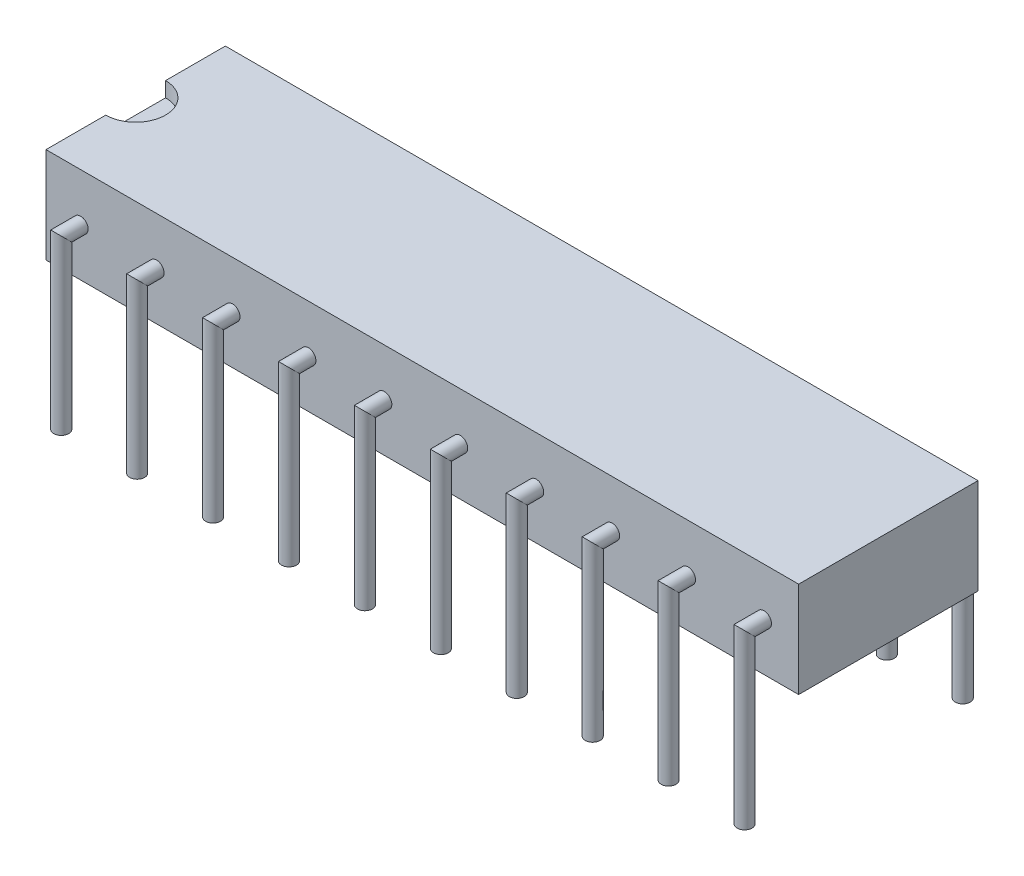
ISO-10303-21;
HEADER;
FILE_DESCRIPTION(('STEP AP214'),'2;1');
FILE_NAME('part.step','',(''),(''),'','','');
FILE_SCHEMA(('AUTOMOTIVE_DESIGN { 1 0 10303 214 1 1 1 1 }'));
ENDSEC;
DATA;
#1=APPLICATION_CONTEXT('core data for automotive mechanical design processes');
#2=APPLICATION_PROTOCOL_DEFINITION('international standard','automotive_design',2000,#1);
#3=PRODUCT_CONTEXT('',#1,'mechanical');
#4=PRODUCT('Part','Part','',(#3));
#5=PRODUCT_RELATED_PRODUCT_CATEGORY('part','',(#4));
#6=PRODUCT_DEFINITION_FORMATION('','',#4);
#7=PRODUCT_DEFINITION_CONTEXT('part definition',#1,'design');
#8=PRODUCT_DEFINITION('design','',#6,#7);
#9=PRODUCT_DEFINITION_SHAPE('','',#8);
#10=(LENGTH_UNIT() NAMED_UNIT(*) SI_UNIT(.MILLI.,.METRE.));
#11=(NAMED_UNIT(*) PLANE_ANGLE_UNIT() SI_UNIT($,.RADIAN.));
#12=(NAMED_UNIT(*) SI_UNIT($,.STERADIAN.) SOLID_ANGLE_UNIT());
#13=UNCERTAINTY_MEASURE_WITH_UNIT(LENGTH_MEASURE(1.E-05),#10,'distance_accuracy_value','');
#14=(GEOMETRIC_REPRESENTATION_CONTEXT(3) GLOBAL_UNCERTAINTY_ASSIGNED_CONTEXT((#13)) GLOBAL_UNIT_ASSIGNED_CONTEXT((#10,
#11,#12)) REPRESENTATION_CONTEXT('',''));
#15=CARTESIAN_POINT('',(0.,0.,0.));
#16=DIRECTION('',(0.,0.,1.));
#17=DIRECTION('',(1.,0.,0.));
#18=AXIS2_PLACEMENT_3D('',#15,#16,#17);
#19=CARTESIAN_POINT('',(25.18,3.2,3.));
#20=DIRECTION('',(0.,0.,-1.));
#21=DIRECTION('',(-1.,0.,0.));
#22=AXIS2_PLACEMENT_3D('',#19,#20,#21);
#23=PLANE('',#22);
#24=CARTESIAN_POINT('',(21.48,1.6,3.));
#25=DIRECTION('',(0.,0.,-1.));
#26=DIRECTION('',(-1.,0.,0.));
#27=AXIS2_PLACEMENT_3D('',#24,#25,#26);
#28=CIRCLE('',#27,0.25);
#29=CARTESIAN_POINT('',(21.23,1.6,3.));
#30=VERTEX_POINT('',#29);
#31=EDGE_CURVE('E60',#30,#30,#28,.F.);
#32=ORIENTED_EDGE('',*,*,#31,.F.);
#33=EDGE_LOOP('',(#32));
#34=FACE_BOUND('',#33,.T.);
#35=CARTESIAN_POINT('',(16.4,1.6,3.));
#36=DIRECTION('',(0.,0.,-1.));
#37=DIRECTION('',(-1.,0.,0.));
#38=AXIS2_PLACEMENT_3D('',#35,#36,#37);
#39=CIRCLE('',#38,0.25);
#40=CARTESIAN_POINT('',(16.15,1.6,3.));
#41=VERTEX_POINT('',#40);
#42=EDGE_CURVE('E175',#41,#41,#39,.F.);
#43=ORIENTED_EDGE('',*,*,#42,.F.);
#44=EDGE_LOOP('',(#43));
#45=FACE_BOUND('',#44,.T.);
#46=CARTESIAN_POINT('',(11.32,1.6,3.));
#47=DIRECTION('',(0.,0.,-1.));
#48=DIRECTION('',(-1.,0.,0.));
#49=AXIS2_PLACEMENT_3D('',#46,#47,#48);
#50=CIRCLE('',#49,0.25);
#51=CARTESIAN_POINT('',(11.07,1.6,3.));
#52=VERTEX_POINT('',#51);
#53=EDGE_CURVE('E169',#52,#52,#50,.F.);
#54=ORIENTED_EDGE('',*,*,#53,.F.);
#55=EDGE_LOOP('',(#54));
#56=FACE_BOUND('',#55,.T.);
#57=CARTESIAN_POINT('',(6.24,1.6,3.));
#58=DIRECTION('',(0.,0.,-1.));
#59=DIRECTION('',(-1.,0.,0.));
#60=AXIS2_PLACEMENT_3D('',#57,#58,#59);
#61=CIRCLE('',#60,0.25);
#62=CARTESIAN_POINT('',(5.99,1.6,3.));
#63=VERTEX_POINT('',#62);
#64=EDGE_CURVE('E163',#63,#63,#61,.F.);
#65=ORIENTED_EDGE('',*,*,#64,.F.);
#66=EDGE_LOOP('',(#65));
#67=FACE_BOUND('',#66,.T.);
#68=CARTESIAN_POINT('',(1.16,1.6,3.));
#69=DIRECTION('',(0.,0.,-1.));
#70=DIRECTION('',(-1.,0.,0.));
#71=AXIS2_PLACEMENT_3D('',#68,#69,#70);
#72=CIRCLE('',#71,0.25);
#73=CARTESIAN_POINT('',(0.91,1.6,3.));
#74=VERTEX_POINT('',#73);
#75=EDGE_CURVE('E157',#74,#74,#72,.F.);
#76=ORIENTED_EDGE('',*,*,#75,.F.);
#77=EDGE_LOOP('',(#76));
#78=FACE_BOUND('',#77,.T.);
#79=DIRECTION('',(0.,-1.,0.));
#80=VECTOR('',#79,1.);
#81=CARTESIAN_POINT('',(0.,3.2,3.));
#82=LINE('',#81,#80);
#83=CARTESIAN_POINT('',(0.,3.2,3.));
#84=VERTEX_POINT('',#83);
#85=CARTESIAN_POINT('',(0.,0.,3.));
#86=VERTEX_POINT('',#85);
#87=EDGE_CURVE('E127',#84,#86,#82,.T.);
#88=ORIENTED_EDGE('',*,*,#87,.T.);
#89=DIRECTION('',(-1.,0.,0.));
#90=VECTOR('',#89,1.);
#91=CARTESIAN_POINT('',(25.18,0.,3.));
#92=LINE('',#91,#90);
#93=CARTESIAN_POINT('',(25.18,0.,3.));
#94=VERTEX_POINT('',#93);
#95=EDGE_CURVE('E155',#94,#86,#92,.T.);
#96=ORIENTED_EDGE('',*,*,#95,.F.);
#97=DIRECTION('',(0.,-1.,0.));
#98=VECTOR('',#97,1.);
#99=CARTESIAN_POINT('',(25.18,3.2,3.));
#100=LINE('',#99,#98);
#101=CARTESIAN_POINT('',(25.18,3.2,3.));
#102=VERTEX_POINT('',#101);
#103=EDGE_CURVE('E135',#102,#94,#100,.T.);
#104=ORIENTED_EDGE('',*,*,#103,.F.);
#105=DIRECTION('',(-1.,0.,0.));
#106=VECTOR('',#105,1.);
#107=CARTESIAN_POINT('',(25.18,3.2,3.));
#108=LINE('',#107,#106);
#109=EDGE_CURVE('E141',#102,#84,#108,.T.);
#110=ORIENTED_EDGE('',*,*,#109,.T.);
#111=EDGE_LOOP('',(#88,#96,#104,#110));
#112=FACE_BOUND('',#111,.T.);
#113=CARTESIAN_POINT('',(3.7,1.6,3.));
#114=DIRECTION('',(0.,0.,-1.));
#115=DIRECTION('',(-1.,0.,0.));
#116=AXIS2_PLACEMENT_3D('',#113,#114,#115);
#117=CIRCLE('',#116,0.25);
#118=CARTESIAN_POINT('',(3.45,1.6,3.));
#119=VERTEX_POINT('',#118);
#120=EDGE_CURVE('E160',#119,#119,#117,.F.);
#121=ORIENTED_EDGE('',*,*,#120,.F.);
#122=EDGE_LOOP('',(#121));
#123=FACE_BOUND('',#122,.T.);
#124=CARTESIAN_POINT('',(8.78,1.6,3.));
#125=DIRECTION('',(0.,0.,-1.));
#126=DIRECTION('',(-1.,0.,0.));
#127=AXIS2_PLACEMENT_3D('',#124,#125,#126);
#128=CIRCLE('',#127,0.25);
#129=CARTESIAN_POINT('',(8.53,1.6,3.));
#130=VERTEX_POINT('',#129);
#131=EDGE_CURVE('E166',#130,#130,#128,.F.);
#132=ORIENTED_EDGE('',*,*,#131,.F.);
#133=EDGE_LOOP('',(#132));
#134=FACE_BOUND('',#133,.T.);
#135=CARTESIAN_POINT('',(13.86,1.6,3.));
#136=DIRECTION('',(0.,0.,-1.));
#137=DIRECTION('',(-1.,0.,0.));
#138=AXIS2_PLACEMENT_3D('',#135,#136,#137);
#139=CIRCLE('',#138,0.25);
#140=CARTESIAN_POINT('',(13.61,1.6,3.));
#141=VERTEX_POINT('',#140);
#142=EDGE_CURVE('E172',#141,#141,#139,.F.);
#143=ORIENTED_EDGE('',*,*,#142,.F.);
#144=EDGE_LOOP('',(#143));
#145=FACE_BOUND('',#144,.T.);
#146=CARTESIAN_POINT('',(18.94,1.6,3.));
#147=DIRECTION('',(0.,0.,-1.));
#148=DIRECTION('',(-1.,0.,0.));
#149=AXIS2_PLACEMENT_3D('',#146,#147,#148);
#150=CIRCLE('',#149,0.25);
#151=CARTESIAN_POINT('',(18.69,1.6,3.));
#152=VERTEX_POINT('',#151);
#153=EDGE_CURVE('E178',#152,#152,#150,.F.);
#154=ORIENTED_EDGE('',*,*,#153,.F.);
#155=EDGE_LOOP('',(#154));
#156=FACE_BOUND('',#155,.T.);
#157=CARTESIAN_POINT('',(24.02,1.6,3.));
#158=DIRECTION('',(0.,0.,-1.));
#159=DIRECTION('',(-1.,0.,0.));
#160=AXIS2_PLACEMENT_3D('',#157,#158,#159);
#161=CIRCLE('',#160,0.25);
#162=CARTESIAN_POINT('',(23.77,1.6,3.));
#163=VERTEX_POINT('',#162);
#164=EDGE_CURVE('E12',#163,#163,#161,.F.);
#165=ORIENTED_EDGE('',*,*,#164,.F.);
#166=EDGE_LOOP('',(#165));
#167=FACE_BOUND('',#166,.T.);
#168=ADVANCED_FACE('F53',(#34,#45,#56,#67,#78,#112,#123,#134,#145,#156,#167),#23,.F.);
#169=CARTESIAN_POINT('',(25.18,0.,3.));
#170=DIRECTION('',(0.,1.,0.));
#171=DIRECTION('',(0.,0.,1.));
#172=AXIS2_PLACEMENT_3D('',#169,#170,#171);
#173=PLANE('',#172);
#174=DIRECTION('',(0.,0.,-1.));
#175=VECTOR('',#174,1.);
#176=CARTESIAN_POINT('',(0.,0.,3.));
#177=LINE('',#176,#175);
#178=CARTESIAN_POINT('',(0.,0.,-3.));
#179=VERTEX_POINT('',#178);
#180=EDGE_CURVE('E130',#86,#179,#177,.T.);
#181=ORIENTED_EDGE('',*,*,#180,.T.);
#182=DIRECTION('',(-1.,0.,0.));
#183=VECTOR('',#182,1.);
#184=CARTESIAN_POINT('',(25.18,0.,-3.));
#185=LINE('',#184,#183);
#186=CARTESIAN_POINT('',(25.18,0.,-3.));
#187=VERTEX_POINT('',#186);
#188=EDGE_CURVE('E152',#187,#179,#185,.T.);
#189=ORIENTED_EDGE('',*,*,#188,.F.);
#190=DIRECTION('',(0.,0.,-1.));
#191=VECTOR('',#190,1.);
#192=CARTESIAN_POINT('',(25.18,0.,3.));
#193=LINE('',#192,#191);
#194=EDGE_CURVE('E104',#94,#187,#193,.T.);
#195=ORIENTED_EDGE('',*,*,#194,.F.);
#196=ORIENTED_EDGE('',*,*,#95,.T.);
#197=EDGE_LOOP('',(#181,#189,#195,#196));
#198=FACE_BOUND('',#197,.T.);
#199=ADVANCED_FACE('F188',(#198),#173,.F.);
#200=CARTESIAN_POINT('',(25.18,3.2,-3.));
#201=DIRECTION('',(0.,0.,1.));
#202=DIRECTION('',(1.,0.,0.));
#203=AXIS2_PLACEMENT_3D('',#200,#201,#202);
#204=PLANE('',#203);
#205=CARTESIAN_POINT('',(24.02,1.6,-3.));
#206=DIRECTION('',(0.,0.,1.));
#207=DIRECTION('',(1.,0.,0.));
#208=AXIS2_PLACEMENT_3D('',#205,#206,#207);
#209=CIRCLE('',#208,0.25);
#210=CARTESIAN_POINT('',(24.27,1.6,-3.));
#211=VERTEX_POINT('',#210);
#212=EDGE_CURVE('E960',#211,#211,#209,.T.);
#213=ORIENTED_EDGE('',*,*,#212,.T.);
#214=EDGE_LOOP('',(#213));
#215=FACE_BOUND('',#214,.T.);
#216=CARTESIAN_POINT('',(21.48,1.6,-3.));
#217=DIRECTION('',(0.,0.,1.));
#218=DIRECTION('',(1.,0.,0.));
#219=AXIS2_PLACEMENT_3D('',#216,#217,#218);
#220=CIRCLE('',#219,0.25);
#221=CARTESIAN_POINT('',(21.73,1.6,-3.));
#222=VERTEX_POINT('',#221);
#223=EDGE_CURVE('E953',#222,#222,#220,.T.);
#224=ORIENTED_EDGE('',*,*,#223,.T.);
#225=EDGE_LOOP('',(#224));
#226=FACE_BOUND('',#225,.T.);
#227=CARTESIAN_POINT('',(18.94,1.6,-3.));
#228=DIRECTION('',(0.,0.,1.));
#229=DIRECTION('',(1.,0.,0.));
#230=AXIS2_PLACEMENT_3D('',#227,#228,#229);
#231=CIRCLE('',#230,0.25);
#232=CARTESIAN_POINT('',(19.19,1.6,-3.));
#233=VERTEX_POINT('',#232);
#234=EDGE_CURVE('E969',#233,#233,#231,.T.);
#235=ORIENTED_EDGE('',*,*,#234,.T.);
#236=EDGE_LOOP('',(#235));
#237=FACE_BOUND('',#236,.T.);
#238=CARTESIAN_POINT('',(16.4,1.6,-3.));
#239=DIRECTION('',(0.,0.,1.));
#240=DIRECTION('',(1.,0.,0.));
#241=AXIS2_PLACEMENT_3D('',#238,#239,#240);
#242=CIRCLE('',#241,0.25);
#243=CARTESIAN_POINT('',(16.65,1.6,-3.));
#244=VERTEX_POINT('',#243);
#245=EDGE_CURVE('E978',#244,#244,#242,.T.);
#246=ORIENTED_EDGE('',*,*,#245,.T.);
#247=EDGE_LOOP('',(#246));
#248=FACE_BOUND('',#247,.T.);
#249=CARTESIAN_POINT('',(13.86,1.6,-3.));
#250=DIRECTION('',(0.,0.,1.));
#251=DIRECTION('',(1.,0.,0.));
#252=AXIS2_PLACEMENT_3D('',#249,#250,#251);
#253=CIRCLE('',#252,0.25);
#254=CARTESIAN_POINT('',(14.11,1.6,-3.));
#255=VERTEX_POINT('',#254);
#256=EDGE_CURVE('E987',#255,#255,#253,.T.);
#257=ORIENTED_EDGE('',*,*,#256,.T.);
#258=EDGE_LOOP('',(#257));
#259=FACE_BOUND('',#258,.T.);
#260=CARTESIAN_POINT('',(11.32,1.6,-3.));
#261=DIRECTION('',(0.,0.,1.));
#262=DIRECTION('',(1.,0.,0.));
#263=AXIS2_PLACEMENT_3D('',#260,#261,#262);
#264=CIRCLE('',#263,0.25);
#265=CARTESIAN_POINT('',(11.57,1.6,-3.));
#266=VERTEX_POINT('',#265);
#267=EDGE_CURVE('E996',#266,#266,#264,.T.);
#268=ORIENTED_EDGE('',*,*,#267,.T.);
#269=EDGE_LOOP('',(#268));
#270=FACE_BOUND('',#269,.T.);
#271=CARTESIAN_POINT('',(8.78,1.6,-3.));
#272=DIRECTION('',(0.,0.,1.));
#273=DIRECTION('',(1.,0.,0.));
#274=AXIS2_PLACEMENT_3D('',#271,#272,#273);
#275=CIRCLE('',#274,0.25);
#276=CARTESIAN_POINT('',(9.03,1.6,-3.));
#277=VERTEX_POINT('',#276);
#278=EDGE_CURVE('E1005',#277,#277,#275,.T.);
#279=ORIENTED_EDGE('',*,*,#278,.T.);
#280=EDGE_LOOP('',(#279));
#281=FACE_BOUND('',#280,.T.);
#282=CARTESIAN_POINT('',(6.24,1.6,-3.));
#283=DIRECTION('',(0.,0.,1.));
#284=DIRECTION('',(1.,0.,0.));
#285=AXIS2_PLACEMENT_3D('',#282,#283,#284);
#286=CIRCLE('',#285,0.25);
#287=CARTESIAN_POINT('',(6.49,1.6,-3.));
#288=VERTEX_POINT('',#287);
#289=EDGE_CURVE('E1014',#288,#288,#286,.T.);
#290=ORIENTED_EDGE('',*,*,#289,.T.);
#291=EDGE_LOOP('',(#290));
#292=FACE_BOUND('',#291,.T.);
#293=CARTESIAN_POINT('',(3.7,1.6,-3.));
#294=DIRECTION('',(0.,0.,1.));
#295=DIRECTION('',(1.,0.,0.));
#296=AXIS2_PLACEMENT_3D('',#293,#294,#295);
#297=CIRCLE('',#296,0.25);
#298=CARTESIAN_POINT('',(3.95,1.6,-3.));
#299=VERTEX_POINT('',#298);
#300=EDGE_CURVE('E1023',#299,#299,#297,.T.);
#301=ORIENTED_EDGE('',*,*,#300,.T.);
#302=EDGE_LOOP('',(#301));
#303=FACE_BOUND('',#302,.T.);
#304=CARTESIAN_POINT('',(1.16,1.6,-3.));
#305=DIRECTION('',(0.,0.,1.));
#306=DIRECTION('',(1.,0.,0.));
#307=AXIS2_PLACEMENT_3D('',#304,#305,#306);
#308=CIRCLE('',#307,0.25);
#309=CARTESIAN_POINT('',(1.41,1.6,-3.));
#310=VERTEX_POINT('',#309);
#311=EDGE_CURVE('E277',#310,#310,#308,.T.);
#312=ORIENTED_EDGE('',*,*,#311,.T.);
#313=EDGE_LOOP('',(#312));
#314=FACE_BOUND('',#313,.T.);
#315=DIRECTION('',(0.,1.,0.));
#316=VECTOR('',#315,1.);
#317=CARTESIAN_POINT('',(0.,3.2,-3.));
#318=LINE('',#317,#316);
#319=CARTESIAN_POINT('',(0.,3.2,-3.));
#320=VERTEX_POINT('',#319);
#321=EDGE_CURVE('E144',#179,#320,#318,.T.);
#322=ORIENTED_EDGE('',*,*,#321,.T.);
#323=DIRECTION('',(-1.,0.,0.));
#324=VECTOR('',#323,1.);
#325=CARTESIAN_POINT('',(25.18,3.2,-3.));
#326=LINE('',#325,#324);
#327=CARTESIAN_POINT('',(25.18,3.2,-3.));
#328=VERTEX_POINT('',#327);
#329=EDGE_CURVE('E149',#328,#320,#326,.T.);
#330=ORIENTED_EDGE('',*,*,#329,.F.);
#331=DIRECTION('',(0.,1.,0.));
#332=VECTOR('',#331,1.);
#333=CARTESIAN_POINT('',(25.18,3.2,-3.));
#334=LINE('',#333,#332);
#335=EDGE_CURVE('E139',#187,#328,#334,.T.);
#336=ORIENTED_EDGE('',*,*,#335,.F.);
#337=ORIENTED_EDGE('',*,*,#188,.T.);
#338=EDGE_LOOP('',(#322,#330,#336,#337));
#339=FACE_BOUND('',#338,.T.);
#340=ADVANCED_FACE('F299',(#215,#226,#237,#248,#259,#270,#281,#292,#303,#314,#339),#204,.F.);
#341=CARTESIAN_POINT('',(25.18,3.2,3.));
#342=DIRECTION('',(0.,-1.,0.));
#343=DIRECTION('',(0.,0.,-1.));
#344=AXIS2_PLACEMENT_3D('',#341,#342,#343);
#345=PLANE('',#344);
#346=DIRECTION('',(0.,0.,1.));
#347=VECTOR('',#346,1.);
#348=CARTESIAN_POINT('',(0.,3.2,3.));
#349=LINE('',#348,#347);
#350=CARTESIAN_POINT('',(0.,3.2,-1.));
#351=VERTEX_POINT('',#350);
#352=EDGE_CURVE('E137',#320,#351,#349,.T.);
#353=ORIENTED_EDGE('',*,*,#352,.T.);
#354=CARTESIAN_POINT('',(0.,3.2,0.));
#355=DIRECTION('',(0.,1.,0.));
#356=DIRECTION('',(0.,0.,1.));
#357=AXIS2_PLACEMENT_3D('',#354,#355,#356);
#358=CIRCLE('',#357,1.);
#359=CARTESIAN_POINT('',(0.,3.2,1.));
#360=VERTEX_POINT('',#359);
#361=EDGE_CURVE('E120',#360,#351,#358,.T.);
#362=ORIENTED_EDGE('',*,*,#361,.F.);
#363=EDGE_CURVE('E96',#360,#84,#349,.T.);
#364=ORIENTED_EDGE('',*,*,#363,.T.);
#365=ORIENTED_EDGE('',*,*,#109,.F.);
#366=DIRECTION('',(0.,0.,1.));
#367=VECTOR('',#366,1.);
#368=CARTESIAN_POINT('',(25.18,3.2,3.));
#369=LINE('',#368,#367);
#370=EDGE_CURVE('E75',#328,#102,#369,.T.);
#371=ORIENTED_EDGE('',*,*,#370,.F.);
#372=ORIENTED_EDGE('',*,*,#329,.T.);
#373=EDGE_LOOP('',(#353,#362,#364,#365,#371,#372));
#374=FACE_BOUND('',#373,.T.);
#375=ADVANCED_FACE('F295',(#374),#345,.F.);
#376=CARTESIAN_POINT('',(25.18,0.,3.));
#377=DIRECTION('',(1.,0.,0.));
#378=DIRECTION('',(0.,0.,-1.));
#379=AXIS2_PLACEMENT_3D('',#376,#377,#378);
#380=PLANE('',#379);
#381=ORIENTED_EDGE('',*,*,#103,.T.);
#382=ORIENTED_EDGE('',*,*,#194,.T.);
#383=ORIENTED_EDGE('',*,*,#335,.T.);
#384=ORIENTED_EDGE('',*,*,#370,.T.);
#385=EDGE_LOOP('',(#381,#382,#383,#384));
#386=FACE_BOUND('',#385,.T.);
#387=ADVANCED_FACE('F301',(#386),#380,.T.);
#388=CARTESIAN_POINT('',(0.,0.,3.));
#389=DIRECTION('',(1.,0.,0.));
#390=DIRECTION('',(0.,0.,-1.));
#391=AXIS2_PLACEMENT_3D('',#388,#389,#390);
#392=PLANE('',#391);
#393=DIRECTION('',(0.,0.,1.));
#394=VECTOR('',#393,1.);
#395=CARTESIAN_POINT('',(0.,2.7,-1.));
#396=LINE('',#395,#394);
#397=CARTESIAN_POINT('',(0.,2.7,-1.));
#398=VERTEX_POINT('',#397);
#399=CARTESIAN_POINT('',(0.,2.7,1.));
#400=VERTEX_POINT('',#399);
#401=EDGE_CURVE('E119',#398,#400,#396,.T.);
#402=ORIENTED_EDGE('',*,*,#401,.F.);
#403=DIRECTION('',(0.,1.,0.));
#404=VECTOR('',#403,1.);
#405=CARTESIAN_POINT('',(0.,2.7,-1.));
#406=LINE('',#405,#404);
#407=EDGE_CURVE('E117',#398,#351,#406,.T.);
#408=ORIENTED_EDGE('',*,*,#407,.T.);
#409=ORIENTED_EDGE('',*,*,#352,.F.);
#410=ORIENTED_EDGE('',*,*,#321,.F.);
#411=ORIENTED_EDGE('',*,*,#180,.F.);
#412=ORIENTED_EDGE('',*,*,#87,.F.);
#413=ORIENTED_EDGE('',*,*,#363,.F.);
#414=DIRECTION('',(0.,1.,0.));
#415=VECTOR('',#414,1.);
#416=CARTESIAN_POINT('',(0.,2.7,1.));
#417=LINE('',#416,#415);
#418=EDGE_CURVE('E115',#400,#360,#417,.T.);
#419=ORIENTED_EDGE('',*,*,#418,.F.);
#420=EDGE_LOOP('',(#402,#408,#409,#410,#411,#412,#413,#419));
#421=FACE_BOUND('',#420,.T.);
#422=ADVANCED_FACE('F125',(#421),#392,.F.);
#423=CARTESIAN_POINT('',(0.,2.7,0.));
#424=DIRECTION('',(0.,1.,0.));
#425=DIRECTION('',(0.,0.,1.));
#426=AXIS2_PLACEMENT_3D('',#423,#424,#425);
#427=CYLINDRICAL_SURFACE('',#426,1.);
#428=ORIENTED_EDGE('',*,*,#361,.T.);
#429=ORIENTED_EDGE('',*,*,#407,.F.);
#430=CARTESIAN_POINT('',(0.,2.7,0.));
#431=DIRECTION('',(0.,1.,0.));
#432=DIRECTION('',(0.,0.,1.));
#433=AXIS2_PLACEMENT_3D('',#430,#431,#432);
#434=CIRCLE('',#433,1.);
#435=EDGE_CURVE('E66',#400,#398,#434,.T.);
#436=ORIENTED_EDGE('',*,*,#435,.F.);
#437=ORIENTED_EDGE('',*,*,#418,.T.);
#438=EDGE_LOOP('',(#428,#429,#436,#437));
#439=FACE_BOUND('',#438,.T.);
#440=ADVANCED_FACE('F113',(#439),#427,.F.);
#441=CARTESIAN_POINT('',(0.,2.7,0.));
#442=DIRECTION('',(0.,1.,0.));
#443=DIRECTION('',(0.,0.,1.));
#444=AXIS2_PLACEMENT_3D('',#441,#442,#443);
#445=PLANE('',#444);
#446=ORIENTED_EDGE('',*,*,#435,.T.);
#447=ORIENTED_EDGE('',*,*,#401,.T.);
#448=EDGE_LOOP('',(#446,#447));
#449=FACE_BOUND('',#448,.T.);
#450=ADVANCED_FACE('F122',(#449),#445,.T.);
#451=CARTESIAN_POINT('',(1.16,1.6,3.65));
#452=DIRECTION('',(0.,-1.,0.));
#453=DIRECTION('',(0.,0.,-1.));
#454=AXIS2_PLACEMENT_3D('',#451,#452,#453);
#455=CYLINDRICAL_SURFACE('',#454,0.25);
#456=CARTESIAN_POINT('',(1.16,1.6,3.65));
#457=DIRECTION('',(0.,-0.707106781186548,0.707106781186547));
#458=DIRECTION('',(0.,-0.707106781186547,-0.707106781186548));
#459=AXIS2_PLACEMENT_3D('',#456,#457,#458);
#460=ELLIPSE('',#459,0.353553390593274,0.25);
#461=CARTESIAN_POINT('',(1.16,1.35,3.4));
#462=VERTEX_POINT('',#461);
#463=EDGE_CURVE('E286',#462,#462,#460,.T.);
#464=ORIENTED_EDGE('',*,*,#463,.T.);
#465=EDGE_LOOP('',(#464));
#466=FACE_BOUND('',#465,.T.);
#467=CARTESIAN_POINT('',(1.16,-4.,3.65));
#468=DIRECTION('',(0.,-1.,0.));
#469=DIRECTION('',(0.,0.,-1.));
#470=AXIS2_PLACEMENT_3D('',#467,#468,#469);
#471=CIRCLE('',#470,0.25);
#472=CARTESIAN_POINT('',(1.16,-4.,3.4));
#473=VERTEX_POINT('',#472);
#474=EDGE_CURVE('E289',#473,#473,#471,.F.);
#475=ORIENTED_EDGE('',*,*,#474,.T.);
#476=EDGE_LOOP('',(#475));
#477=FACE_BOUND('',#476,.T.);
#478=ADVANCED_FACE('F353',(#466,#477),#455,.T.);
#479=CARTESIAN_POINT('',(1.16,1.6,4.35710678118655));
#480=DIRECTION('',(0.,0.,-1.));
#481=DIRECTION('',(0.,1.,0.));
#482=AXIS2_PLACEMENT_3D('',#479,#480,#481);
#483=CYLINDRICAL_SURFACE('',#482,0.25);
#484=ORIENTED_EDGE('',*,*,#75,.T.);
#485=EDGE_LOOP('',(#484));
#486=FACE_BOUND('',#485,.T.);
#487=ORIENTED_EDGE('',*,*,#463,.F.);
#488=EDGE_LOOP('',(#487));
#489=FACE_BOUND('',#488,.T.);
#490=ADVANCED_FACE('F361',(#486,#489),#483,.T.);
#491=CARTESIAN_POINT('',(1.16,-4.,3.65));
#492=DIRECTION('',(0.,-1.,0.));
#493=DIRECTION('',(0.,0.,-1.));
#494=AXIS2_PLACEMENT_3D('',#491,#492,#493);
#495=PLANE('',#494);
#496=ORIENTED_EDGE('',*,*,#474,.F.);
#497=EDGE_LOOP('',(#496));
#498=FACE_BOUND('',#497,.T.);
#499=ADVANCED_FACE('F371',(#498),#495,.T.);
#500=CARTESIAN_POINT('',(1.16,1.6,-3.65));
#501=DIRECTION('',(0.,-1.,0.));
#502=DIRECTION('',(0.,0.,-1.));
#503=AXIS2_PLACEMENT_3D('',#500,#501,#502);
#504=CYLINDRICAL_SURFACE('',#503,0.25);
#505=CARTESIAN_POINT('',(1.16,1.6,-3.65));
#506=DIRECTION('',(0.,-0.707106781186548,-0.707106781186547));
#507=DIRECTION('',(0.,-0.707106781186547,0.707106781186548));
#508=AXIS2_PLACEMENT_3D('',#505,#506,#507);
#509=ELLIPSE('',#508,0.353553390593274,0.25);
#510=CARTESIAN_POINT('',(1.16,1.35,-3.4));
#511=VERTEX_POINT('',#510);
#512=EDGE_CURVE('E280',#511,#511,#509,.F.);
#513=ORIENTED_EDGE('',*,*,#512,.F.);
#514=EDGE_LOOP('',(#513));
#515=FACE_BOUND('',#514,.T.);
#516=CARTESIAN_POINT('',(1.16,-4.,-3.65));
#517=DIRECTION('',(0.,-1.,0.));
#518=DIRECTION('',(0.,0.,-1.));
#519=AXIS2_PLACEMENT_3D('',#516,#517,#518);
#520=CIRCLE('',#519,0.25);
#521=CARTESIAN_POINT('',(1.16,-4.,-3.9));
#522=VERTEX_POINT('',#521);
#523=EDGE_CURVE('E283',#522,#522,#520,.T.);
#524=ORIENTED_EDGE('',*,*,#523,.F.);
#525=EDGE_LOOP('',(#524));
#526=FACE_BOUND('',#525,.T.);
#527=ADVANCED_FACE('F381',(#515,#526),#504,.T.);
#528=CARTESIAN_POINT('',(1.16,1.6,-4.35710678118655));
#529=DIRECTION('',(0.,0.,1.));
#530=DIRECTION('',(0.,-1.,0.));
#531=AXIS2_PLACEMENT_3D('',#528,#529,#530);
#532=CYLINDRICAL_SURFACE('',#531,0.25);
#533=ORIENTED_EDGE('',*,*,#311,.F.);
#534=EDGE_LOOP('',(#533));
#535=FACE_BOUND('',#534,.T.);
#536=ORIENTED_EDGE('',*,*,#512,.T.);
#537=EDGE_LOOP('',(#536));
#538=FACE_BOUND('',#537,.T.);
#539=ADVANCED_FACE('F391',(#535,#538),#532,.T.);
#540=CARTESIAN_POINT('',(1.16,-4.,-3.65));
#541=DIRECTION('',(0.,-1.,0.));
#542=DIRECTION('',(0.,0.,-1.));
#543=AXIS2_PLACEMENT_3D('',#540,#541,#542);
#544=PLANE('',#543);
#545=ORIENTED_EDGE('',*,*,#523,.T.);
#546=EDGE_LOOP('',(#545));
#547=FACE_BOUND('',#546,.T.);
#548=ADVANCED_FACE('F401',(#547),#544,.T.);
#549=CARTESIAN_POINT('',(3.7,1.6,3.65));
#550=DIRECTION('',(0.,-1.,0.));
#551=DIRECTION('',(0.,0.,-1.));
#552=AXIS2_PLACEMENT_3D('',#549,#550,#551);
#553=CYLINDRICAL_SURFACE('',#552,0.25);
#554=CARTESIAN_POINT('',(3.7,1.6,3.65));
#555=DIRECTION('',(0.,-0.707106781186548,0.707106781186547));
#556=DIRECTION('',(0.,-0.707106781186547,-0.707106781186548));
#557=AXIS2_PLACEMENT_3D('',#554,#555,#556);
#558=ELLIPSE('',#557,0.353553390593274,0.25);
#559=CARTESIAN_POINT('',(3.7,1.35,3.4));
#560=VERTEX_POINT('',#559);
#561=EDGE_CURVE('E271',#560,#560,#558,.T.);
#562=ORIENTED_EDGE('',*,*,#561,.T.);
#563=EDGE_LOOP('',(#562));
#564=FACE_BOUND('',#563,.T.);
#565=CARTESIAN_POINT('',(3.7,-4.,3.65));
#566=DIRECTION('',(0.,-1.,0.));
#567=DIRECTION('',(0.,0.,-1.));
#568=AXIS2_PLACEMENT_3D('',#565,#566,#567);
#569=CIRCLE('',#568,0.25);
#570=CARTESIAN_POINT('',(3.7,-4.,3.4));
#571=VERTEX_POINT('',#570);
#572=EDGE_CURVE('E274',#571,#571,#569,.F.);
#573=ORIENTED_EDGE('',*,*,#572,.T.);
#574=EDGE_LOOP('',(#573));
#575=FACE_BOUND('',#574,.T.);
#576=ADVANCED_FACE('F410',(#564,#575),#553,.T.);
#577=CARTESIAN_POINT('',(3.7,1.6,4.35710678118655));
#578=DIRECTION('',(0.,0.,-1.));
#579=DIRECTION('',(0.,1.,0.));
#580=AXIS2_PLACEMENT_3D('',#577,#578,#579);
#581=CYLINDRICAL_SURFACE('',#580,0.25);
#582=ORIENTED_EDGE('',*,*,#120,.T.);
#583=EDGE_LOOP('',(#582));
#584=FACE_BOUND('',#583,.T.);
#585=ORIENTED_EDGE('',*,*,#561,.F.);
#586=EDGE_LOOP('',(#585));
#587=FACE_BOUND('',#586,.T.);
#588=ADVANCED_FACE('F425',(#584,#587),#581,.T.);
#589=CARTESIAN_POINT('',(3.7,-4.,3.65));
#590=DIRECTION('',(0.,-1.,0.));
#591=DIRECTION('',(0.,0.,-1.));
#592=AXIS2_PLACEMENT_3D('',#589,#590,#591);
#593=PLANE('',#592);
#594=ORIENTED_EDGE('',*,*,#572,.F.);
#595=EDGE_LOOP('',(#594));
#596=FACE_BOUND('',#595,.T.);
#597=ADVANCED_FACE('F434',(#596),#593,.T.);
#598=CARTESIAN_POINT('',(6.24,1.6,3.65));
#599=DIRECTION('',(0.,-1.,0.));
#600=DIRECTION('',(0.,0.,-1.));
#601=AXIS2_PLACEMENT_3D('',#598,#599,#600);
#602=CYLINDRICAL_SURFACE('',#601,0.25);
#603=CARTESIAN_POINT('',(6.24,1.6,3.65));
#604=DIRECTION('',(0.,-0.707106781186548,0.707106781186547));
#605=DIRECTION('',(0.,-0.707106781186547,-0.707106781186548));
#606=AXIS2_PLACEMENT_3D('',#603,#604,#605);
#607=ELLIPSE('',#606,0.353553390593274,0.25);
#608=CARTESIAN_POINT('',(6.24,1.35,3.4));
#609=VERTEX_POINT('',#608);
#610=EDGE_CURVE('E265',#609,#609,#607,.T.);
#611=ORIENTED_EDGE('',*,*,#610,.T.);
#612=EDGE_LOOP('',(#611));
#613=FACE_BOUND('',#612,.T.);
#614=CARTESIAN_POINT('',(6.24,-4.,3.65));
#615=DIRECTION('',(0.,-1.,0.));
#616=DIRECTION('',(0.,0.,-1.));
#617=AXIS2_PLACEMENT_3D('',#614,#615,#616);
#618=CIRCLE('',#617,0.25);
#619=CARTESIAN_POINT('',(6.24,-4.,3.4));
#620=VERTEX_POINT('',#619);
#621=EDGE_CURVE('E268',#620,#620,#618,.F.);
#622=ORIENTED_EDGE('',*,*,#621,.T.);
#623=EDGE_LOOP('',(#622));
#624=FACE_BOUND('',#623,.T.);
#625=ADVANCED_FACE('F443',(#613,#624),#602,.T.);
#626=CARTESIAN_POINT('',(6.24,1.6,4.35710678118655));
#627=DIRECTION('',(0.,0.,-1.));
#628=DIRECTION('',(0.,1.,0.));
#629=AXIS2_PLACEMENT_3D('',#626,#627,#628);
#630=CYLINDRICAL_SURFACE('',#629,0.25);
#631=ORIENTED_EDGE('',*,*,#64,.T.);
#632=EDGE_LOOP('',(#631));
#633=FACE_BOUND('',#632,.T.);
#634=ORIENTED_EDGE('',*,*,#610,.F.);
#635=EDGE_LOOP('',(#634));
#636=FACE_BOUND('',#635,.T.);
#637=ADVANCED_FACE('F452',(#633,#636),#630,.T.);
#638=CARTESIAN_POINT('',(6.24,-4.,3.65));
#639=DIRECTION('',(0.,-1.,0.));
#640=DIRECTION('',(0.,0.,-1.));
#641=AXIS2_PLACEMENT_3D('',#638,#639,#640);
#642=PLANE('',#641);
#643=ORIENTED_EDGE('',*,*,#621,.F.);
#644=EDGE_LOOP('',(#643));
#645=FACE_BOUND('',#644,.T.);
#646=ADVANCED_FACE('F461',(#645),#642,.T.);
#647=CARTESIAN_POINT('',(8.78,1.6,3.65));
#648=DIRECTION('',(0.,-1.,0.));
#649=DIRECTION('',(0.,0.,-1.));
#650=AXIS2_PLACEMENT_3D('',#647,#648,#649);
#651=CYLINDRICAL_SURFACE('',#650,0.25);
#652=CARTESIAN_POINT('',(8.78,1.6,3.65));
#653=DIRECTION('',(0.,-0.707106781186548,0.707106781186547));
#654=DIRECTION('',(0.,-0.707106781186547,-0.707106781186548));
#655=AXIS2_PLACEMENT_3D('',#652,#653,#654);
#656=ELLIPSE('',#655,0.353553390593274,0.25);
#657=CARTESIAN_POINT('',(8.78,1.35,3.4));
#658=VERTEX_POINT('',#657);
#659=EDGE_CURVE('E259',#658,#658,#656,.T.);
#660=ORIENTED_EDGE('',*,*,#659,.T.);
#661=EDGE_LOOP('',(#660));
#662=FACE_BOUND('',#661,.T.);
#663=CARTESIAN_POINT('',(8.78,-4.,3.65));
#664=DIRECTION('',(0.,-1.,0.));
#665=DIRECTION('',(0.,0.,-1.));
#666=AXIS2_PLACEMENT_3D('',#663,#664,#665);
#667=CIRCLE('',#666,0.25);
#668=CARTESIAN_POINT('',(8.78,-4.,3.4));
#669=VERTEX_POINT('',#668);
#670=EDGE_CURVE('E262',#669,#669,#667,.F.);
#671=ORIENTED_EDGE('',*,*,#670,.T.);
#672=EDGE_LOOP('',(#671));
#673=FACE_BOUND('',#672,.T.);
#674=ADVANCED_FACE('F470',(#662,#673),#651,.T.);
#675=CARTESIAN_POINT('',(8.78,1.6,4.35710678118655));
#676=DIRECTION('',(0.,0.,-1.));
#677=DIRECTION('',(0.,1.,0.));
#678=AXIS2_PLACEMENT_3D('',#675,#676,#677);
#679=CYLINDRICAL_SURFACE('',#678,0.25);
#680=ORIENTED_EDGE('',*,*,#131,.T.);
#681=EDGE_LOOP('',(#680));
#682=FACE_BOUND('',#681,.T.);
#683=ORIENTED_EDGE('',*,*,#659,.F.);
#684=EDGE_LOOP('',(#683));
#685=FACE_BOUND('',#684,.T.);
#686=ADVANCED_FACE('F479',(#682,#685),#679,.T.);
#687=CARTESIAN_POINT('',(8.78,-4.,3.65));
#688=DIRECTION('',(0.,-1.,0.));
#689=DIRECTION('',(0.,0.,-1.));
#690=AXIS2_PLACEMENT_3D('',#687,#688,#689);
#691=PLANE('',#690);
#692=ORIENTED_EDGE('',*,*,#670,.F.);
#693=EDGE_LOOP('',(#692));
#694=FACE_BOUND('',#693,.T.);
#695=ADVANCED_FACE('F488',(#694),#691,.T.);
#696=CARTESIAN_POINT('',(11.32,1.6,3.65));
#697=DIRECTION('',(0.,-1.,0.));
#698=DIRECTION('',(0.,0.,-1.));
#699=AXIS2_PLACEMENT_3D('',#696,#697,#698);
#700=CYLINDRICAL_SURFACE('',#699,0.25);
#701=CARTESIAN_POINT('',(11.32,1.6,3.65));
#702=DIRECTION('',(0.,-0.707106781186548,0.707106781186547));
#703=DIRECTION('',(0.,-0.707106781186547,-0.707106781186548));
#704=AXIS2_PLACEMENT_3D('',#701,#702,#703);
#705=ELLIPSE('',#704,0.353553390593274,0.25);
#706=CARTESIAN_POINT('',(11.32,1.35,3.4));
#707=VERTEX_POINT('',#706);
#708=EDGE_CURVE('E253',#707,#707,#705,.T.);
#709=ORIENTED_EDGE('',*,*,#708,.T.);
#710=EDGE_LOOP('',(#709));
#711=FACE_BOUND('',#710,.T.);
#712=CARTESIAN_POINT('',(11.32,-4.,3.65));
#713=DIRECTION('',(0.,-1.,0.));
#714=DIRECTION('',(0.,0.,-1.));
#715=AXIS2_PLACEMENT_3D('',#712,#713,#714);
#716=CIRCLE('',#715,0.25);
#717=CARTESIAN_POINT('',(11.32,-4.,3.4));
#718=VERTEX_POINT('',#717);
#719=EDGE_CURVE('E256',#718,#718,#716,.F.);
#720=ORIENTED_EDGE('',*,*,#719,.T.);
#721=EDGE_LOOP('',(#720));
#722=FACE_BOUND('',#721,.T.);
#723=ADVANCED_FACE('F497',(#711,#722),#700,.T.);
#724=CARTESIAN_POINT('',(11.32,1.6,4.35710678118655));
#725=DIRECTION('',(0.,0.,-1.));
#726=DIRECTION('',(0.,1.,0.));
#727=AXIS2_PLACEMENT_3D('',#724,#725,#726);
#728=CYLINDRICAL_SURFACE('',#727,0.25);
#729=ORIENTED_EDGE('',*,*,#53,.T.);
#730=EDGE_LOOP('',(#729));
#731=FACE_BOUND('',#730,.T.);
#732=ORIENTED_EDGE('',*,*,#708,.F.);
#733=EDGE_LOOP('',(#732));
#734=FACE_BOUND('',#733,.T.);
#735=ADVANCED_FACE('F506',(#731,#734),#728,.T.);
#736=CARTESIAN_POINT('',(11.32,-4.,3.65));
#737=DIRECTION('',(0.,-1.,0.));
#738=DIRECTION('',(0.,0.,-1.));
#739=AXIS2_PLACEMENT_3D('',#736,#737,#738);
#740=PLANE('',#739);
#741=ORIENTED_EDGE('',*,*,#719,.F.);
#742=EDGE_LOOP('',(#741));
#743=FACE_BOUND('',#742,.T.);
#744=ADVANCED_FACE('F515',(#743),#740,.T.);
#745=CARTESIAN_POINT('',(13.86,1.6,3.65));
#746=DIRECTION('',(0.,-1.,0.));
#747=DIRECTION('',(0.,0.,-1.));
#748=AXIS2_PLACEMENT_3D('',#745,#746,#747);
#749=CYLINDRICAL_SURFACE('',#748,0.25);
#750=CARTESIAN_POINT('',(13.86,1.6,3.65));
#751=DIRECTION('',(0.,-0.707106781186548,0.707106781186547));
#752=DIRECTION('',(0.,-0.707106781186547,-0.707106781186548));
#753=AXIS2_PLACEMENT_3D('',#750,#751,#752);
#754=ELLIPSE('',#753,0.353553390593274,0.25);
#755=CARTESIAN_POINT('',(13.86,1.35,3.4));
#756=VERTEX_POINT('',#755);
#757=EDGE_CURVE('E247',#756,#756,#754,.T.);
#758=ORIENTED_EDGE('',*,*,#757,.T.);
#759=EDGE_LOOP('',(#758));
#760=FACE_BOUND('',#759,.T.);
#761=CARTESIAN_POINT('',(13.86,-4.,3.65));
#762=DIRECTION('',(0.,-1.,0.));
#763=DIRECTION('',(0.,0.,-1.));
#764=AXIS2_PLACEMENT_3D('',#761,#762,#763);
#765=CIRCLE('',#764,0.25);
#766=CARTESIAN_POINT('',(13.86,-4.,3.4));
#767=VERTEX_POINT('',#766);
#768=EDGE_CURVE('E250',#767,#767,#765,.F.);
#769=ORIENTED_EDGE('',*,*,#768,.T.);
#770=EDGE_LOOP('',(#769));
#771=FACE_BOUND('',#770,.T.);
#772=ADVANCED_FACE('F524',(#760,#771),#749,.T.);
#773=CARTESIAN_POINT('',(13.86,1.6,4.35710678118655));
#774=DIRECTION('',(0.,0.,-1.));
#775=DIRECTION('',(0.,1.,0.));
#776=AXIS2_PLACEMENT_3D('',#773,#774,#775);
#777=CYLINDRICAL_SURFACE('',#776,0.25);
#778=ORIENTED_EDGE('',*,*,#142,.T.);
#779=EDGE_LOOP('',(#778));
#780=FACE_BOUND('',#779,.T.);
#781=ORIENTED_EDGE('',*,*,#757,.F.);
#782=EDGE_LOOP('',(#781));
#783=FACE_BOUND('',#782,.T.);
#784=ADVANCED_FACE('F533',(#780,#783),#777,.T.);
#785=CARTESIAN_POINT('',(13.86,-4.,3.65));
#786=DIRECTION('',(0.,-1.,0.));
#787=DIRECTION('',(0.,0.,-1.));
#788=AXIS2_PLACEMENT_3D('',#785,#786,#787);
#789=PLANE('',#788);
#790=ORIENTED_EDGE('',*,*,#768,.F.);
#791=EDGE_LOOP('',(#790));
#792=FACE_BOUND('',#791,.T.);
#793=ADVANCED_FACE('F542',(#792),#789,.T.);
#794=CARTESIAN_POINT('',(16.4,1.6,3.65));
#795=DIRECTION('',(0.,-1.,0.));
#796=DIRECTION('',(0.,0.,-1.));
#797=AXIS2_PLACEMENT_3D('',#794,#795,#796);
#798=CYLINDRICAL_SURFACE('',#797,0.25);
#799=CARTESIAN_POINT('',(16.4,1.6,3.65));
#800=DIRECTION('',(0.,-0.707106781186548,0.707106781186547));
#801=DIRECTION('',(0.,-0.707106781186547,-0.707106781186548));
#802=AXIS2_PLACEMENT_3D('',#799,#800,#801);
#803=ELLIPSE('',#802,0.353553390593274,0.25);
#804=CARTESIAN_POINT('',(16.4,1.35,3.4));
#805=VERTEX_POINT('',#804);
#806=EDGE_CURVE('E241',#805,#805,#803,.T.);
#807=ORIENTED_EDGE('',*,*,#806,.T.);
#808=EDGE_LOOP('',(#807));
#809=FACE_BOUND('',#808,.T.);
#810=CARTESIAN_POINT('',(16.4,-4.,3.65));
#811=DIRECTION('',(0.,-1.,0.));
#812=DIRECTION('',(0.,0.,-1.));
#813=AXIS2_PLACEMENT_3D('',#810,#811,#812);
#814=CIRCLE('',#813,0.25);
#815=CARTESIAN_POINT('',(16.4,-4.,3.4));
#816=VERTEX_POINT('',#815);
#817=EDGE_CURVE('E244',#816,#816,#814,.F.);
#818=ORIENTED_EDGE('',*,*,#817,.T.);
#819=EDGE_LOOP('',(#818));
#820=FACE_BOUND('',#819,.T.);
#821=ADVANCED_FACE('F551',(#809,#820),#798,.T.);
#822=CARTESIAN_POINT('',(16.4,1.6,4.35710678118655));
#823=DIRECTION('',(0.,0.,-1.));
#824=DIRECTION('',(0.,1.,0.));
#825=AXIS2_PLACEMENT_3D('',#822,#823,#824);
#826=CYLINDRICAL_SURFACE('',#825,0.25);
#827=ORIENTED_EDGE('',*,*,#42,.T.);
#828=EDGE_LOOP('',(#827));
#829=FACE_BOUND('',#828,.T.);
#830=ORIENTED_EDGE('',*,*,#806,.F.);
#831=EDGE_LOOP('',(#830));
#832=FACE_BOUND('',#831,.T.);
#833=ADVANCED_FACE('F560',(#829,#832),#826,.T.);
#834=CARTESIAN_POINT('',(16.4,-4.,3.65));
#835=DIRECTION('',(0.,-1.,0.));
#836=DIRECTION('',(0.,0.,-1.));
#837=AXIS2_PLACEMENT_3D('',#834,#835,#836);
#838=PLANE('',#837);
#839=ORIENTED_EDGE('',*,*,#817,.F.);
#840=EDGE_LOOP('',(#839));
#841=FACE_BOUND('',#840,.T.);
#842=ADVANCED_FACE('F569',(#841),#838,.T.);
#843=CARTESIAN_POINT('',(18.94,1.6,3.65));
#844=DIRECTION('',(0.,-1.,0.));
#845=DIRECTION('',(0.,0.,-1.));
#846=AXIS2_PLACEMENT_3D('',#843,#844,#845);
#847=CYLINDRICAL_SURFACE('',#846,0.25);
#848=CARTESIAN_POINT('',(18.94,1.6,3.65));
#849=DIRECTION('',(0.,-0.707106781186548,0.707106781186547));
#850=DIRECTION('',(0.,-0.707106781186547,-0.707106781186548));
#851=AXIS2_PLACEMENT_3D('',#848,#849,#850);
#852=ELLIPSE('',#851,0.353553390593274,0.25);
#853=CARTESIAN_POINT('',(18.94,1.35,3.4));
#854=VERTEX_POINT('',#853);
#855=EDGE_CURVE('E235',#854,#854,#852,.T.);
#856=ORIENTED_EDGE('',*,*,#855,.T.);
#857=EDGE_LOOP('',(#856));
#858=FACE_BOUND('',#857,.T.);
#859=CARTESIAN_POINT('',(18.94,-4.,3.65));
#860=DIRECTION('',(0.,-1.,0.));
#861=DIRECTION('',(0.,0.,-1.));
#862=AXIS2_PLACEMENT_3D('',#859,#860,#861);
#863=CIRCLE('',#862,0.25);
#864=CARTESIAN_POINT('',(18.94,-4.,3.4));
#865=VERTEX_POINT('',#864);
#866=EDGE_CURVE('E238',#865,#865,#863,.F.);
#867=ORIENTED_EDGE('',*,*,#866,.T.);
#868=EDGE_LOOP('',(#867));
#869=FACE_BOUND('',#868,.T.);
#870=ADVANCED_FACE('F578',(#858,#869),#847,.T.);
#871=CARTESIAN_POINT('',(18.94,1.6,4.35710678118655));
#872=DIRECTION('',(0.,0.,-1.));
#873=DIRECTION('',(0.,1.,0.));
#874=AXIS2_PLACEMENT_3D('',#871,#872,#873);
#875=CYLINDRICAL_SURFACE('',#874,0.25);
#876=ORIENTED_EDGE('',*,*,#153,.T.);
#877=EDGE_LOOP('',(#876));
#878=FACE_BOUND('',#877,.T.);
#879=ORIENTED_EDGE('',*,*,#855,.F.);
#880=EDGE_LOOP('',(#879));
#881=FACE_BOUND('',#880,.T.);
#882=ADVANCED_FACE('F587',(#878,#881),#875,.T.);
#883=CARTESIAN_POINT('',(18.94,-4.,3.65));
#884=DIRECTION('',(0.,-1.,0.));
#885=DIRECTION('',(0.,0.,-1.));
#886=AXIS2_PLACEMENT_3D('',#883,#884,#885);
#887=PLANE('',#886);
#888=ORIENTED_EDGE('',*,*,#866,.F.);
#889=EDGE_LOOP('',(#888));
#890=FACE_BOUND('',#889,.T.);
#891=ADVANCED_FACE('F596',(#890),#887,.T.);
#892=CARTESIAN_POINT('',(21.48,1.6,3.65));
#893=DIRECTION('',(0.,-1.,0.));
#894=DIRECTION('',(0.,0.,-1.));
#895=AXIS2_PLACEMENT_3D('',#892,#893,#894);
#896=CYLINDRICAL_SURFACE('',#895,0.25);
#897=CARTESIAN_POINT('',(21.48,1.6,3.65));
#898=DIRECTION('',(0.,-0.707106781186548,0.707106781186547));
#899=DIRECTION('',(0.,-0.707106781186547,-0.707106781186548));
#900=AXIS2_PLACEMENT_3D('',#897,#898,#899);
#901=ELLIPSE('',#900,0.353553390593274,0.25);
#902=CARTESIAN_POINT('',(21.48,1.35,3.4));
#903=VERTEX_POINT('',#902);
#904=EDGE_CURVE('E223',#903,#903,#901,.T.);
#905=ORIENTED_EDGE('',*,*,#904,.T.);
#906=EDGE_LOOP('',(#905));
#907=FACE_BOUND('',#906,.T.);
#908=CARTESIAN_POINT('',(21.48,-4.,3.65));
#909=DIRECTION('',(0.,-1.,0.));
#910=DIRECTION('',(0.,0.,-1.));
#911=AXIS2_PLACEMENT_3D('',#908,#909,#910);
#912=CIRCLE('',#911,0.25);
#913=CARTESIAN_POINT('',(21.48,-4.,3.4));
#914=VERTEX_POINT('',#913);
#915=EDGE_CURVE('E232',#914,#914,#912,.F.);
#916=ORIENTED_EDGE('',*,*,#915,.T.);
#917=EDGE_LOOP('',(#916));
#918=FACE_BOUND('',#917,.T.);
#919=ADVANCED_FACE('F605',(#907,#918),#896,.T.);
#920=CARTESIAN_POINT('',(21.48,1.6,4.35710678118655));
#921=DIRECTION('',(0.,0.,-1.));
#922=DIRECTION('',(0.,1.,0.));
#923=AXIS2_PLACEMENT_3D('',#920,#921,#922);
#924=CYLINDRICAL_SURFACE('',#923,0.25);
#925=ORIENTED_EDGE('',*,*,#31,.T.);
#926=EDGE_LOOP('',(#925));
#927=FACE_BOUND('',#926,.T.);
#928=ORIENTED_EDGE('',*,*,#904,.F.);
#929=EDGE_LOOP('',(#928));
#930=FACE_BOUND('',#929,.T.);
#931=ADVANCED_FACE('F183',(#927,#930),#924,.T.);
#932=CARTESIAN_POINT('',(21.48,-4.,3.65));
#933=DIRECTION('',(0.,-1.,0.));
#934=DIRECTION('',(0.,0.,-1.));
#935=AXIS2_PLACEMENT_3D('',#932,#933,#934);
#936=PLANE('',#935);
#937=ORIENTED_EDGE('',*,*,#915,.F.);
#938=EDGE_LOOP('',(#937));
#939=FACE_BOUND('',#938,.T.);
#940=ADVANCED_FACE('F622',(#939),#936,.T.);
#941=CARTESIAN_POINT('',(24.02,1.6,3.65));
#942=DIRECTION('',(0.,-1.,0.));
#943=DIRECTION('',(0.,0.,-1.));
#944=AXIS2_PLACEMENT_3D('',#941,#942,#943);
#945=CYLINDRICAL_SURFACE('',#944,0.25);
#946=CARTESIAN_POINT('',(24.02,1.6,3.65));
#947=DIRECTION('',(0.,-0.707106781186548,0.707106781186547));
#948=DIRECTION('',(0.,-0.707106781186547,-0.707106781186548));
#949=AXIS2_PLACEMENT_3D('',#946,#947,#948);
#950=ELLIPSE('',#949,0.353553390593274,0.25);
#951=CARTESIAN_POINT('',(24.02,1.35,3.4));
#952=VERTEX_POINT('',#951);
#953=EDGE_CURVE('E217',#952,#952,#950,.T.);
#954=ORIENTED_EDGE('',*,*,#953,.T.);
#955=EDGE_LOOP('',(#954));
#956=FACE_BOUND('',#955,.T.);
#957=CARTESIAN_POINT('',(24.02,-4.,3.65));
#958=DIRECTION('',(0.,-1.,0.));
#959=DIRECTION('',(0.,0.,-1.));
#960=AXIS2_PLACEMENT_3D('',#957,#958,#959);
#961=CIRCLE('',#960,0.25);
#962=CARTESIAN_POINT('',(24.02,-4.,3.4));
#963=VERTEX_POINT('',#962);
#964=EDGE_CURVE('E219',#963,#963,#961,.F.);
#965=ORIENTED_EDGE('',*,*,#964,.T.);
#966=EDGE_LOOP('',(#965));
#967=FACE_BOUND('',#966,.T.);
#968=ADVANCED_FACE('F213',(#956,#967),#945,.T.);
#969=CARTESIAN_POINT('',(24.02,1.6,4.35710678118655));
#970=DIRECTION('',(0.,0.,-1.));
#971=DIRECTION('',(0.,1.,0.));
#972=AXIS2_PLACEMENT_3D('',#969,#970,#971);
#973=CYLINDRICAL_SURFACE('',#972,0.25);
#974=ORIENTED_EDGE('',*,*,#164,.T.);
#975=EDGE_LOOP('',(#974));
#976=FACE_BOUND('',#975,.T.);
#977=ORIENTED_EDGE('',*,*,#953,.F.);
#978=EDGE_LOOP('',(#977));
#979=FACE_BOUND('',#978,.T.);
#980=ADVANCED_FACE('F209',(#976,#979),#973,.T.);
#981=CARTESIAN_POINT('',(24.02,-4.,3.65));
#982=DIRECTION('',(0.,-1.,0.));
#983=DIRECTION('',(0.,0.,-1.));
#984=AXIS2_PLACEMENT_3D('',#981,#982,#983);
#985=PLANE('',#984);
#986=ORIENTED_EDGE('',*,*,#964,.F.);
#987=EDGE_LOOP('',(#986));
#988=FACE_BOUND('',#987,.T.);
#989=ADVANCED_FACE('F212',(#988),#985,.T.);
#990=CARTESIAN_POINT('',(3.7,1.6,-3.65));
#991=DIRECTION('',(0.,-1.,0.));
#992=DIRECTION('',(0.,0.,-1.));
#993=AXIS2_PLACEMENT_3D('',#990,#991,#992);
#994=CYLINDRICAL_SURFACE('',#993,0.25);
#995=CARTESIAN_POINT('',(3.7,1.6,-3.65));
#996=DIRECTION('',(0.,-0.707106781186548,-0.707106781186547));
#997=DIRECTION('',(0.,-0.707106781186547,0.707106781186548));
#998=AXIS2_PLACEMENT_3D('',#995,#996,#997);
#999=ELLIPSE('',#998,0.353553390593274,0.25);
#1000=CARTESIAN_POINT('',(3.7,1.35,-3.4));
#1001=VERTEX_POINT('',#1000);
#1002=EDGE_CURVE('E226',#1001,#1001,#999,.F.);
#1003=ORIENTED_EDGE('',*,*,#1002,.F.);
#1004=EDGE_LOOP('',(#1003));
#1005=FACE_BOUND('',#1004,.T.);
#1006=CARTESIAN_POINT('',(3.7,-4.,-3.65));
#1007=DIRECTION('',(0.,-1.,0.));
#1008=DIRECTION('',(0.,0.,-1.));
#1009=AXIS2_PLACEMENT_3D('',#1006,#1007,#1008);
#1010=CIRCLE('',#1009,0.25);
#1011=CARTESIAN_POINT('',(3.7,-4.,-3.9));
#1012=VERTEX_POINT('',#1011);
#1013=EDGE_CURVE('E220',#1012,#1012,#1010,.T.);
#1014=ORIENTED_EDGE('',*,*,#1013,.F.);
#1015=EDGE_LOOP('',(#1014));
#1016=FACE_BOUND('',#1015,.T.);
#1017=ADVANCED_FACE('F650',(#1005,#1016),#994,.T.);
#1018=CARTESIAN_POINT('',(3.7,1.6,-4.35710678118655));
#1019=DIRECTION('',(0.,0.,1.));
#1020=DIRECTION('',(0.,-1.,0.));
#1021=AXIS2_PLACEMENT_3D('',#1018,#1019,#1020);
#1022=CYLINDRICAL_SURFACE('',#1021,0.25);
#1023=ORIENTED_EDGE('',*,*,#300,.F.);
#1024=EDGE_LOOP('',(#1023));
#1025=FACE_BOUND('',#1024,.T.);
#1026=ORIENTED_EDGE('',*,*,#1002,.T.);
#1027=EDGE_LOOP('',(#1026));
#1028=FACE_BOUND('',#1027,.T.);
#1029=ADVANCED_FACE('F659',(#1025,#1028),#1022,.T.);
#1030=CARTESIAN_POINT('',(3.7,-4.,-3.65));
#1031=DIRECTION('',(0.,-1.,0.));
#1032=DIRECTION('',(0.,0.,-1.));
#1033=AXIS2_PLACEMENT_3D('',#1030,#1031,#1032);
#1034=PLANE('',#1033);
#1035=ORIENTED_EDGE('',*,*,#1013,.T.);
#1036=EDGE_LOOP('',(#1035));
#1037=FACE_BOUND('',#1036,.T.);
#1038=ADVANCED_FACE('F668',(#1037),#1034,.T.);
#1039=CARTESIAN_POINT('',(6.24,1.6,-3.65));
#1040=DIRECTION('',(0.,-1.,0.));
#1041=DIRECTION('',(0.,0.,-1.));
#1042=AXIS2_PLACEMENT_3D('',#1039,#1040,#1041);
#1043=CYLINDRICAL_SURFACE('',#1042,0.25);
#1044=CARTESIAN_POINT('',(6.24,1.6,-3.65));
#1045=DIRECTION('',(0.,-0.707106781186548,-0.707106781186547));
#1046=DIRECTION('',(0.,-0.707106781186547,0.707106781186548));
#1047=AXIS2_PLACEMENT_3D('',#1044,#1045,#1046);
#1048=ELLIPSE('',#1047,0.353553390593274,0.25);
#1049=CARTESIAN_POINT('',(6.24,1.35,-3.4));
#1050=VERTEX_POINT('',#1049);
#1051=EDGE_CURVE('E1017',#1050,#1050,#1048,.F.);
#1052=ORIENTED_EDGE('',*,*,#1051,.F.);
#1053=EDGE_LOOP('',(#1052));
#1054=FACE_BOUND('',#1053,.T.);
#1055=CARTESIAN_POINT('',(6.24,-4.,-3.65));
#1056=DIRECTION('',(0.,-1.,0.));
#1057=DIRECTION('',(0.,0.,-1.));
#1058=AXIS2_PLACEMENT_3D('',#1055,#1056,#1057);
#1059=CIRCLE('',#1058,0.25);
#1060=CARTESIAN_POINT('',(6.24,-4.,-3.9));
#1061=VERTEX_POINT('',#1060);
#1062=EDGE_CURVE('E1020',#1061,#1061,#1059,.T.);
#1063=ORIENTED_EDGE('',*,*,#1062,.F.);
#1064=EDGE_LOOP('',(#1063));
#1065=FACE_BOUND('',#1064,.T.);
#1066=ADVANCED_FACE('F677',(#1054,#1065),#1043,.T.);
#1067=CARTESIAN_POINT('',(6.24,1.6,-4.35710678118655));
#1068=DIRECTION('',(0.,0.,1.));
#1069=DIRECTION('',(0.,-1.,0.));
#1070=AXIS2_PLACEMENT_3D('',#1067,#1068,#1069);
#1071=CYLINDRICAL_SURFACE('',#1070,0.25);
#1072=ORIENTED_EDGE('',*,*,#289,.F.);
#1073=EDGE_LOOP('',(#1072));
#1074=FACE_BOUND('',#1073,.T.);
#1075=ORIENTED_EDGE('',*,*,#1051,.T.);
#1076=EDGE_LOOP('',(#1075));
#1077=FACE_BOUND('',#1076,.T.);
#1078=ADVANCED_FACE('F686',(#1074,#1077),#1071,.T.);
#1079=CARTESIAN_POINT('',(6.24,-4.,-3.65));
#1080=DIRECTION('',(0.,-1.,0.));
#1081=DIRECTION('',(0.,0.,-1.));
#1082=AXIS2_PLACEMENT_3D('',#1079,#1080,#1081);
#1083=PLANE('',#1082);
#1084=ORIENTED_EDGE('',*,*,#1062,.T.);
#1085=EDGE_LOOP('',(#1084));
#1086=FACE_BOUND('',#1085,.T.);
#1087=ADVANCED_FACE('F695',(#1086),#1083,.T.);
#1088=CARTESIAN_POINT('',(8.78,1.6,-3.65));
#1089=DIRECTION('',(0.,-1.,0.));
#1090=DIRECTION('',(0.,0.,-1.));
#1091=AXIS2_PLACEMENT_3D('',#1088,#1089,#1090);
#1092=CYLINDRICAL_SURFACE('',#1091,0.25);
#1093=CARTESIAN_POINT('',(8.78,1.6,-3.65));
#1094=DIRECTION('',(0.,-0.707106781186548,-0.707106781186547));
#1095=DIRECTION('',(0.,-0.707106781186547,0.707106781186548));
#1096=AXIS2_PLACEMENT_3D('',#1093,#1094,#1095);
#1097=ELLIPSE('',#1096,0.353553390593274,0.25);
#1098=CARTESIAN_POINT('',(8.78,1.35,-3.4));
#1099=VERTEX_POINT('',#1098);
#1100=EDGE_CURVE('E1008',#1099,#1099,#1097,.F.);
#1101=ORIENTED_EDGE('',*,*,#1100,.F.);
#1102=EDGE_LOOP('',(#1101));
#1103=FACE_BOUND('',#1102,.T.);
#1104=CARTESIAN_POINT('',(8.78,-4.,-3.65));
#1105=DIRECTION('',(0.,-1.,0.));
#1106=DIRECTION('',(0.,0.,-1.));
#1107=AXIS2_PLACEMENT_3D('',#1104,#1105,#1106);
#1108=CIRCLE('',#1107,0.25);
#1109=CARTESIAN_POINT('',(8.78,-4.,-3.9));
#1110=VERTEX_POINT('',#1109);
#1111=EDGE_CURVE('E1011',#1110,#1110,#1108,.T.);
#1112=ORIENTED_EDGE('',*,*,#1111,.F.);
#1113=EDGE_LOOP('',(#1112));
#1114=FACE_BOUND('',#1113,.T.);
#1115=ADVANCED_FACE('F704',(#1103,#1114),#1092,.T.);
#1116=CARTESIAN_POINT('',(8.78,1.6,-4.35710678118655));
#1117=DIRECTION('',(0.,0.,1.));
#1118=DIRECTION('',(0.,-1.,0.));
#1119=AXIS2_PLACEMENT_3D('',#1116,#1117,#1118);
#1120=CYLINDRICAL_SURFACE('',#1119,0.25);
#1121=ORIENTED_EDGE('',*,*,#278,.F.);
#1122=EDGE_LOOP('',(#1121));
#1123=FACE_BOUND('',#1122,.T.);
#1124=ORIENTED_EDGE('',*,*,#1100,.T.);
#1125=EDGE_LOOP('',(#1124));
#1126=FACE_BOUND('',#1125,.T.);
#1127=ADVANCED_FACE('F713',(#1123,#1126),#1120,.T.);
#1128=CARTESIAN_POINT('',(8.78,-4.,-3.65));
#1129=DIRECTION('',(0.,-1.,0.));
#1130=DIRECTION('',(0.,0.,-1.));
#1131=AXIS2_PLACEMENT_3D('',#1128,#1129,#1130);
#1132=PLANE('',#1131);
#1133=ORIENTED_EDGE('',*,*,#1111,.T.);
#1134=EDGE_LOOP('',(#1133));
#1135=FACE_BOUND('',#1134,.T.);
#1136=ADVANCED_FACE('F722',(#1135),#1132,.T.);
#1137=CARTESIAN_POINT('',(11.32,1.6,-3.65));
#1138=DIRECTION('',(0.,-1.,0.));
#1139=DIRECTION('',(0.,0.,-1.));
#1140=AXIS2_PLACEMENT_3D('',#1137,#1138,#1139);
#1141=CYLINDRICAL_SURFACE('',#1140,0.25);
#1142=CARTESIAN_POINT('',(11.32,1.6,-3.65));
#1143=DIRECTION('',(0.,-0.707106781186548,-0.707106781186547));
#1144=DIRECTION('',(0.,-0.707106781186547,0.707106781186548));
#1145=AXIS2_PLACEMENT_3D('',#1142,#1143,#1144);
#1146=ELLIPSE('',#1145,0.353553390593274,0.25);
#1147=CARTESIAN_POINT('',(11.32,1.35,-3.4));
#1148=VERTEX_POINT('',#1147);
#1149=EDGE_CURVE('E999',#1148,#1148,#1146,.F.);
#1150=ORIENTED_EDGE('',*,*,#1149,.F.);
#1151=EDGE_LOOP('',(#1150));
#1152=FACE_BOUND('',#1151,.T.);
#1153=CARTESIAN_POINT('',(11.32,-4.,-3.65));
#1154=DIRECTION('',(0.,-1.,0.));
#1155=DIRECTION('',(0.,0.,-1.));
#1156=AXIS2_PLACEMENT_3D('',#1153,#1154,#1155);
#1157=CIRCLE('',#1156,0.25);
#1158=CARTESIAN_POINT('',(11.32,-4.,-3.9));
#1159=VERTEX_POINT('',#1158);
#1160=EDGE_CURVE('E1002',#1159,#1159,#1157,.T.);
#1161=ORIENTED_EDGE('',*,*,#1160,.F.);
#1162=EDGE_LOOP('',(#1161));
#1163=FACE_BOUND('',#1162,.T.);
#1164=ADVANCED_FACE('F731',(#1152,#1163),#1141,.T.);
#1165=CARTESIAN_POINT('',(11.32,1.6,-4.35710678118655));
#1166=DIRECTION('',(0.,0.,1.));
#1167=DIRECTION('',(0.,-1.,0.));
#1168=AXIS2_PLACEMENT_3D('',#1165,#1166,#1167);
#1169=CYLINDRICAL_SURFACE('',#1168,0.25);
#1170=ORIENTED_EDGE('',*,*,#267,.F.);
#1171=EDGE_LOOP('',(#1170));
#1172=FACE_BOUND('',#1171,.T.);
#1173=ORIENTED_EDGE('',*,*,#1149,.T.);
#1174=EDGE_LOOP('',(#1173));
#1175=FACE_BOUND('',#1174,.T.);
#1176=ADVANCED_FACE('F740',(#1172,#1175),#1169,.T.);
#1177=CARTESIAN_POINT('',(11.32,-4.,-3.65));
#1178=DIRECTION('',(0.,-1.,0.));
#1179=DIRECTION('',(0.,0.,-1.));
#1180=AXIS2_PLACEMENT_3D('',#1177,#1178,#1179);
#1181=PLANE('',#1180);
#1182=ORIENTED_EDGE('',*,*,#1160,.T.);
#1183=EDGE_LOOP('',(#1182));
#1184=FACE_BOUND('',#1183,.T.);
#1185=ADVANCED_FACE('F749',(#1184),#1181,.T.);
#1186=CARTESIAN_POINT('',(13.86,1.6,-3.65));
#1187=DIRECTION('',(0.,-1.,0.));
#1188=DIRECTION('',(0.,0.,-1.));
#1189=AXIS2_PLACEMENT_3D('',#1186,#1187,#1188);
#1190=CYLINDRICAL_SURFACE('',#1189,0.25);
#1191=CARTESIAN_POINT('',(13.86,1.6,-3.65));
#1192=DIRECTION('',(0.,-0.707106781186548,-0.707106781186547));
#1193=DIRECTION('',(0.,-0.707106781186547,0.707106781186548));
#1194=AXIS2_PLACEMENT_3D('',#1191,#1192,#1193);
#1195=ELLIPSE('',#1194,0.353553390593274,0.25);
#1196=CARTESIAN_POINT('',(13.86,1.35,-3.4));
#1197=VERTEX_POINT('',#1196);
#1198=EDGE_CURVE('E990',#1197,#1197,#1195,.F.);
#1199=ORIENTED_EDGE('',*,*,#1198,.F.);
#1200=EDGE_LOOP('',(#1199));
#1201=FACE_BOUND('',#1200,.T.);
#1202=CARTESIAN_POINT('',(13.86,-4.,-3.65));
#1203=DIRECTION('',(0.,-1.,0.));
#1204=DIRECTION('',(0.,0.,-1.));
#1205=AXIS2_PLACEMENT_3D('',#1202,#1203,#1204);
#1206=CIRCLE('',#1205,0.25);
#1207=CARTESIAN_POINT('',(13.86,-4.,-3.9));
#1208=VERTEX_POINT('',#1207);
#1209=EDGE_CURVE('E993',#1208,#1208,#1206,.T.);
#1210=ORIENTED_EDGE('',*,*,#1209,.F.);
#1211=EDGE_LOOP('',(#1210));
#1212=FACE_BOUND('',#1211,.T.);
#1213=ADVANCED_FACE('F758',(#1201,#1212),#1190,.T.);
#1214=CARTESIAN_POINT('',(13.86,1.6,-4.35710678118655));
#1215=DIRECTION('',(0.,0.,1.));
#1216=DIRECTION('',(0.,-1.,0.));
#1217=AXIS2_PLACEMENT_3D('',#1214,#1215,#1216);
#1218=CYLINDRICAL_SURFACE('',#1217,0.25);
#1219=ORIENTED_EDGE('',*,*,#256,.F.);
#1220=EDGE_LOOP('',(#1219));
#1221=FACE_BOUND('',#1220,.T.);
#1222=ORIENTED_EDGE('',*,*,#1198,.T.);
#1223=EDGE_LOOP('',(#1222));
#1224=FACE_BOUND('',#1223,.T.);
#1225=ADVANCED_FACE('F767',(#1221,#1224),#1218,.T.);
#1226=CARTESIAN_POINT('',(13.86,-4.,-3.65));
#1227=DIRECTION('',(0.,-1.,0.));
#1228=DIRECTION('',(0.,0.,-1.));
#1229=AXIS2_PLACEMENT_3D('',#1226,#1227,#1228);
#1230=PLANE('',#1229);
#1231=ORIENTED_EDGE('',*,*,#1209,.T.);
#1232=EDGE_LOOP('',(#1231));
#1233=FACE_BOUND('',#1232,.T.);
#1234=ADVANCED_FACE('F776',(#1233),#1230,.T.);
#1235=CARTESIAN_POINT('',(16.4,1.6,-3.65));
#1236=DIRECTION('',(0.,-1.,0.));
#1237=DIRECTION('',(0.,0.,-1.));
#1238=AXIS2_PLACEMENT_3D('',#1235,#1236,#1237);
#1239=CYLINDRICAL_SURFACE('',#1238,0.25);
#1240=CARTESIAN_POINT('',(16.4,1.6,-3.65));
#1241=DIRECTION('',(0.,-0.707106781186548,-0.707106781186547));
#1242=DIRECTION('',(0.,-0.707106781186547,0.707106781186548));
#1243=AXIS2_PLACEMENT_3D('',#1240,#1241,#1242);
#1244=ELLIPSE('',#1243,0.353553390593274,0.25);
#1245=CARTESIAN_POINT('',(16.4,1.35,-3.4));
#1246=VERTEX_POINT('',#1245);
#1247=EDGE_CURVE('E981',#1246,#1246,#1244,.F.);
#1248=ORIENTED_EDGE('',*,*,#1247,.F.);
#1249=EDGE_LOOP('',(#1248));
#1250=FACE_BOUND('',#1249,.T.);
#1251=CARTESIAN_POINT('',(16.4,-4.,-3.65));
#1252=DIRECTION('',(0.,-1.,0.));
#1253=DIRECTION('',(0.,0.,-1.));
#1254=AXIS2_PLACEMENT_3D('',#1251,#1252,#1253);
#1255=CIRCLE('',#1254,0.25);
#1256=CARTESIAN_POINT('',(16.4,-4.,-3.9));
#1257=VERTEX_POINT('',#1256);
#1258=EDGE_CURVE('E984',#1257,#1257,#1255,.T.);
#1259=ORIENTED_EDGE('',*,*,#1258,.F.);
#1260=EDGE_LOOP('',(#1259));
#1261=FACE_BOUND('',#1260,.T.);
#1262=ADVANCED_FACE('F785',(#1250,#1261),#1239,.T.);
#1263=CARTESIAN_POINT('',(16.4,1.6,-4.35710678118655));
#1264=DIRECTION('',(0.,0.,1.));
#1265=DIRECTION('',(0.,-1.,0.));
#1266=AXIS2_PLACEMENT_3D('',#1263,#1264,#1265);
#1267=CYLINDRICAL_SURFACE('',#1266,0.25);
#1268=ORIENTED_EDGE('',*,*,#245,.F.);
#1269=EDGE_LOOP('',(#1268));
#1270=FACE_BOUND('',#1269,.T.);
#1271=ORIENTED_EDGE('',*,*,#1247,.T.);
#1272=EDGE_LOOP('',(#1271));
#1273=FACE_BOUND('',#1272,.T.);
#1274=ADVANCED_FACE('F794',(#1270,#1273),#1267,.T.);
#1275=CARTESIAN_POINT('',(16.4,-4.,-3.65));
#1276=DIRECTION('',(0.,-1.,0.));
#1277=DIRECTION('',(0.,0.,-1.));
#1278=AXIS2_PLACEMENT_3D('',#1275,#1276,#1277);
#1279=PLANE('',#1278);
#1280=ORIENTED_EDGE('',*,*,#1258,.T.);
#1281=EDGE_LOOP('',(#1280));
#1282=FACE_BOUND('',#1281,.T.);
#1283=ADVANCED_FACE('F803',(#1282),#1279,.T.);
#1284=CARTESIAN_POINT('',(18.94,1.6,-3.65));
#1285=DIRECTION('',(0.,-1.,0.));
#1286=DIRECTION('',(0.,0.,-1.));
#1287=AXIS2_PLACEMENT_3D('',#1284,#1285,#1286);
#1288=CYLINDRICAL_SURFACE('',#1287,0.25);
#1289=CARTESIAN_POINT('',(18.94,1.6,-3.65));
#1290=DIRECTION('',(0.,-0.707106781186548,-0.707106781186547));
#1291=DIRECTION('',(0.,-0.707106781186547,0.707106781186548));
#1292=AXIS2_PLACEMENT_3D('',#1289,#1290,#1291);
#1293=ELLIPSE('',#1292,0.353553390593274,0.25);
#1294=CARTESIAN_POINT('',(18.94,1.35,-3.4));
#1295=VERTEX_POINT('',#1294);
#1296=EDGE_CURVE('E972',#1295,#1295,#1293,.F.);
#1297=ORIENTED_EDGE('',*,*,#1296,.F.);
#1298=EDGE_LOOP('',(#1297));
#1299=FACE_BOUND('',#1298,.T.);
#1300=CARTESIAN_POINT('',(18.94,-4.,-3.65));
#1301=DIRECTION('',(0.,-1.,0.));
#1302=DIRECTION('',(0.,0.,-1.));
#1303=AXIS2_PLACEMENT_3D('',#1300,#1301,#1302);
#1304=CIRCLE('',#1303,0.25);
#1305=CARTESIAN_POINT('',(18.94,-4.,-3.9));
#1306=VERTEX_POINT('',#1305);
#1307=EDGE_CURVE('E975',#1306,#1306,#1304,.T.);
#1308=ORIENTED_EDGE('',*,*,#1307,.F.);
#1309=EDGE_LOOP('',(#1308));
#1310=FACE_BOUND('',#1309,.T.);
#1311=ADVANCED_FACE('F812',(#1299,#1310),#1288,.T.);
#1312=CARTESIAN_POINT('',(18.94,1.6,-4.35710678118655));
#1313=DIRECTION('',(0.,0.,1.));
#1314=DIRECTION('',(0.,-1.,0.));
#1315=AXIS2_PLACEMENT_3D('',#1312,#1313,#1314);
#1316=CYLINDRICAL_SURFACE('',#1315,0.25);
#1317=ORIENTED_EDGE('',*,*,#234,.F.);
#1318=EDGE_LOOP('',(#1317));
#1319=FACE_BOUND('',#1318,.T.);
#1320=ORIENTED_EDGE('',*,*,#1296,.T.);
#1321=EDGE_LOOP('',(#1320));
#1322=FACE_BOUND('',#1321,.T.);
#1323=ADVANCED_FACE('F821',(#1319,#1322),#1316,.T.);
#1324=CARTESIAN_POINT('',(18.94,-4.,-3.65));
#1325=DIRECTION('',(0.,-1.,0.));
#1326=DIRECTION('',(0.,0.,-1.));
#1327=AXIS2_PLACEMENT_3D('',#1324,#1325,#1326);
#1328=PLANE('',#1327);
#1329=ORIENTED_EDGE('',*,*,#1307,.T.);
#1330=EDGE_LOOP('',(#1329));
#1331=FACE_BOUND('',#1330,.T.);
#1332=ADVANCED_FACE('F830',(#1331),#1328,.T.);
#1333=CARTESIAN_POINT('',(21.48,1.6,-3.65));
#1334=DIRECTION('',(0.,-1.,0.));
#1335=DIRECTION('',(0.,0.,-1.));
#1336=AXIS2_PLACEMENT_3D('',#1333,#1334,#1335);
#1337=CYLINDRICAL_SURFACE('',#1336,0.25);
#1338=CARTESIAN_POINT('',(21.48,1.6,-3.65));
#1339=DIRECTION('',(0.,-0.707106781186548,-0.707106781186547));
#1340=DIRECTION('',(0.,-0.707106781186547,0.707106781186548));
#1341=AXIS2_PLACEMENT_3D('',#1338,#1339,#1340);
#1342=ELLIPSE('',#1341,0.353553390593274,0.25);
#1343=CARTESIAN_POINT('',(21.48,1.35,-3.4));
#1344=VERTEX_POINT('',#1343);
#1345=EDGE_CURVE('E957',#1344,#1344,#1342,.F.);
#1346=ORIENTED_EDGE('',*,*,#1345,.F.);
#1347=EDGE_LOOP('',(#1346));
#1348=FACE_BOUND('',#1347,.T.);
#1349=CARTESIAN_POINT('',(21.48,-4.,-3.65));
#1350=DIRECTION('',(0.,-1.,0.));
#1351=DIRECTION('',(0.,0.,-1.));
#1352=AXIS2_PLACEMENT_3D('',#1349,#1350,#1351);
#1353=CIRCLE('',#1352,0.25);
#1354=CARTESIAN_POINT('',(21.48,-4.,-3.9));
#1355=VERTEX_POINT('',#1354);
#1356=EDGE_CURVE('E966',#1355,#1355,#1353,.T.);
#1357=ORIENTED_EDGE('',*,*,#1356,.F.);
#1358=EDGE_LOOP('',(#1357));
#1359=FACE_BOUND('',#1358,.T.);
#1360=ADVANCED_FACE('F839',(#1348,#1359),#1337,.T.);
#1361=CARTESIAN_POINT('',(21.48,1.6,-4.35710678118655));
#1362=DIRECTION('',(0.,0.,1.));
#1363=DIRECTION('',(0.,-1.,0.));
#1364=AXIS2_PLACEMENT_3D('',#1361,#1362,#1363);
#1365=CYLINDRICAL_SURFACE('',#1364,0.25);
#1366=ORIENTED_EDGE('',*,*,#223,.F.);
#1367=EDGE_LOOP('',(#1366));
#1368=FACE_BOUND('',#1367,.T.);
#1369=ORIENTED_EDGE('',*,*,#1345,.T.);
#1370=EDGE_LOOP('',(#1369));
#1371=FACE_BOUND('',#1370,.T.);
#1372=ADVANCED_FACE('F848',(#1368,#1371),#1365,.T.);
#1373=CARTESIAN_POINT('',(21.48,-4.,-3.65));
#1374=DIRECTION('',(0.,-1.,0.));
#1375=DIRECTION('',(0.,0.,-1.));
#1376=AXIS2_PLACEMENT_3D('',#1373,#1374,#1375);
#1377=PLANE('',#1376);
#1378=ORIENTED_EDGE('',*,*,#1356,.T.);
#1379=EDGE_LOOP('',(#1378));
#1380=FACE_BOUND('',#1379,.T.);
#1381=ADVANCED_FACE('F857',(#1380),#1377,.T.);
#1382=CARTESIAN_POINT('',(24.02,1.6,-3.65));
#1383=DIRECTION('',(0.,-1.,0.));
#1384=DIRECTION('',(0.,0.,-1.));
#1385=AXIS2_PLACEMENT_3D('',#1382,#1383,#1384);
#1386=CYLINDRICAL_SURFACE('',#1385,0.25);
#1387=CARTESIAN_POINT('',(24.02,1.6,-3.65));
#1388=DIRECTION('',(0.,-0.707106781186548,-0.707106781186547));
#1389=DIRECTION('',(0.,-0.707106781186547,0.707106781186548));
#1390=AXIS2_PLACEMENT_3D('',#1387,#1388,#1389);
#1391=ELLIPSE('',#1390,0.353553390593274,0.25);
#1392=CARTESIAN_POINT('',(24.02,1.35,-3.4));
#1393=VERTEX_POINT('',#1392);
#1394=EDGE_CURVE('E954',#1393,#1393,#1391,.F.);
#1395=ORIENTED_EDGE('',*,*,#1394,.F.);
#1396=EDGE_LOOP('',(#1395));
#1397=FACE_BOUND('',#1396,.T.);
#1398=CARTESIAN_POINT('',(24.02,-4.,-3.65));
#1399=DIRECTION('',(0.,-1.,0.));
#1400=DIRECTION('',(0.,0.,-1.));
#1401=AXIS2_PLACEMENT_3D('',#1398,#1399,#1400);
#1402=CIRCLE('',#1401,0.25);
#1403=CARTESIAN_POINT('',(24.02,-4.,-3.9));
#1404=VERTEX_POINT('',#1403);
#1405=EDGE_CURVE('E951',#1404,#1404,#1402,.T.);
#1406=ORIENTED_EDGE('',*,*,#1405,.F.);
#1407=EDGE_LOOP('',(#1406));
#1408=FACE_BOUND('',#1407,.T.);
#1409=ADVANCED_FACE('F866',(#1397,#1408),#1386,.T.);
#1410=CARTESIAN_POINT('',(24.02,1.6,-4.35710678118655));
#1411=DIRECTION('',(0.,0.,1.));
#1412=DIRECTION('',(0.,-1.,0.));
#1413=AXIS2_PLACEMENT_3D('',#1410,#1411,#1412);
#1414=CYLINDRICAL_SURFACE('',#1413,0.25);
#1415=ORIENTED_EDGE('',*,*,#212,.F.);
#1416=EDGE_LOOP('',(#1415));
#1417=FACE_BOUND('',#1416,.T.);
#1418=ORIENTED_EDGE('',*,*,#1394,.T.);
#1419=EDGE_LOOP('',(#1418));
#1420=FACE_BOUND('',#1419,.T.);
#1421=ADVANCED_FACE('F875',(#1417,#1420),#1414,.T.);
#1422=CARTESIAN_POINT('',(24.02,-4.,-3.65));
#1423=DIRECTION('',(0.,-1.,0.));
#1424=DIRECTION('',(0.,0.,-1.));
#1425=AXIS2_PLACEMENT_3D('',#1422,#1423,#1424);
#1426=PLANE('',#1425);
#1427=ORIENTED_EDGE('',*,*,#1405,.T.);
#1428=EDGE_LOOP('',(#1427));
#1429=FACE_BOUND('',#1428,.T.);
#1430=ADVANCED_FACE('F884',(#1429),#1426,.T.);
#1431=CLOSED_SHELL('',(#168,#199,#340,#375,#387,#422,#440,#450,#478,#490,#499,#527,#539,#548,
#576,#588,#597,#625,#637,#646,#674,#686,#695,#723,#735,#744,#772,#784,#793,#821,#833,#842,#870,
#882,#891,#919,#931,#940,#968,#980,#989,#1017,#1029,#1038,#1066,#1078,#1087,#1115,#1127,#1136,
#1164,#1176,#1185,#1213,#1225,#1234,#1262,#1274,#1283,#1311,#1323,#1332,#1360,#1372,#1381,#1409,
#1421,#1430));
#1432=MANIFOLD_SOLID_BREP('B2',#1431);
#1433=ADVANCED_BREP_SHAPE_REPRESENTATION('',(#18,#1432),#14);
#1434=SHAPE_DEFINITION_REPRESENTATION(#9,#1433);
ENDSEC;
END-ISO-10303-21;
